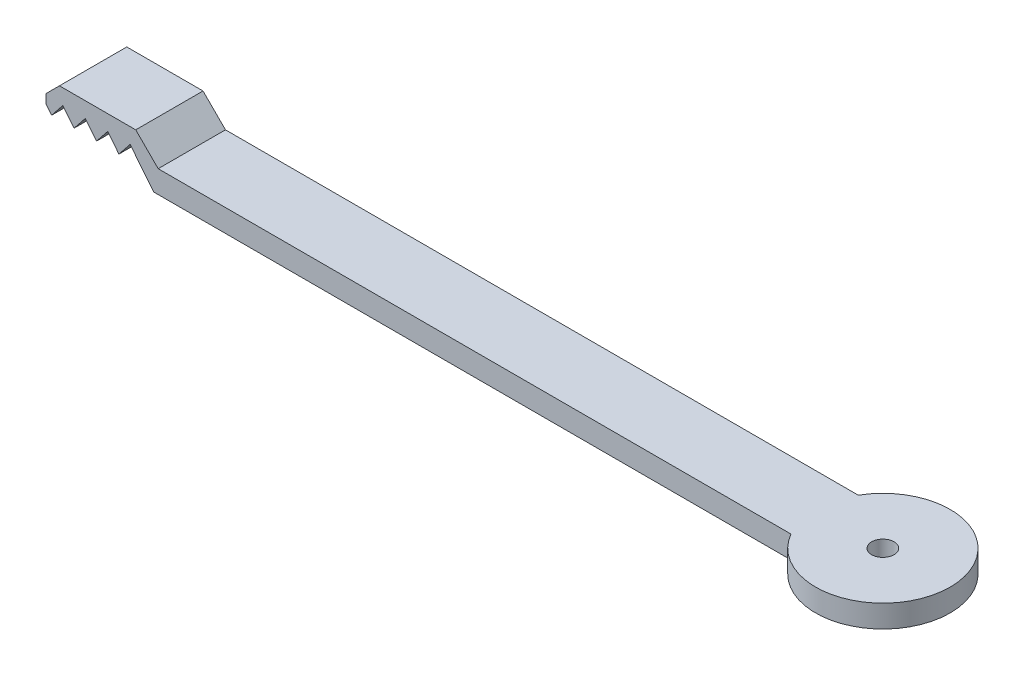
ISO-10303-21;
HEADER;
FILE_DESCRIPTION(('STEP AP214'),'2;1');
FILE_NAME('part.step','',(''),(''),'','','');
FILE_SCHEMA(('AUTOMOTIVE_DESIGN { 1 0 10303 214 1 1 1 1 }'));
ENDSEC;
DATA;
#1=APPLICATION_CONTEXT('core data for automotive mechanical design processes');
#2=APPLICATION_PROTOCOL_DEFINITION('international standard','automotive_design',2000,#1);
#3=PRODUCT_CONTEXT('',#1,'mechanical');
#4=PRODUCT('Part','Part','',(#3));
#5=PRODUCT_RELATED_PRODUCT_CATEGORY('part','',(#4));
#6=PRODUCT_DEFINITION_FORMATION('','',#4);
#7=PRODUCT_DEFINITION_CONTEXT('part definition',#1,'design');
#8=PRODUCT_DEFINITION('design','',#6,#7);
#9=PRODUCT_DEFINITION_SHAPE('','',#8);
#10=(LENGTH_UNIT() NAMED_UNIT(*) SI_UNIT(.MILLI.,.METRE.));
#11=(NAMED_UNIT(*) PLANE_ANGLE_UNIT() SI_UNIT($,.RADIAN.));
#12=(NAMED_UNIT(*) SI_UNIT($,.STERADIAN.) SOLID_ANGLE_UNIT());
#13=UNCERTAINTY_MEASURE_WITH_UNIT(LENGTH_MEASURE(1.E-05),#10,'distance_accuracy_value','');
#14=(GEOMETRIC_REPRESENTATION_CONTEXT(3) GLOBAL_UNCERTAINTY_ASSIGNED_CONTEXT((#13)) GLOBAL_UNIT_ASSIGNED_CONTEXT((#10,
#11,#12)) REPRESENTATION_CONTEXT('',''));
#15=CARTESIAN_POINT('',(0.,0.,0.));
#16=DIRECTION('',(0.,0.,1.));
#17=DIRECTION('',(1.,0.,0.));
#18=AXIS2_PLACEMENT_3D('',#15,#16,#17);
#19=CARTESIAN_POINT('',(157.736236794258,35.4387505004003,-55.01));
#20=DIRECTION('',(0.780624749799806,0.624999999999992,0.));
#21=DIRECTION('',(-0.624999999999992,0.780624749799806,0.));
#22=AXIS2_PLACEMENT_3D('',#19,#20,#21);
#23=PLANE('',#22);
#24=DIRECTION('',(0.624999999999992,-0.780624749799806,0.));
#25=VECTOR('',#24,1.);
#26=CARTESIAN_POINT('',(228.852940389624,-53.3859838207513,-32.5));
#27=LINE('',#26,#25);
#28=CARTESIAN_POINT('',(156.486236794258,37.,-32.4999999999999));
#29=VERTEX_POINT('',#28);
#30=CARTESIAN_POINT('',(157.736236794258,35.4387505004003,-32.4999999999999));
#31=VERTEX_POINT('',#30);
#32=EDGE_CURVE('E219',#29,#31,#27,.T.);
#33=ORIENTED_EDGE('',*,*,#32,.T.);
#34=DIRECTION('',(0.,0.,1.));
#35=VECTOR('',#34,1.);
#36=CARTESIAN_POINT('',(157.736236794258,35.4387505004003,-55.01));
#37=LINE('',#36,#35);
#38=CARTESIAN_POINT('',(157.736236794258,35.4387505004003,-17.5));
#39=VERTEX_POINT('',#38);
#40=EDGE_CURVE('E12',#31,#39,#37,.T.);
#41=ORIENTED_EDGE('',*,*,#40,.T.);
#42=DIRECTION('',(-0.624999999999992,0.780624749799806,0.));
#43=VECTOR('',#42,1.);
#44=CARTESIAN_POINT('',(228.852940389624,-53.3859838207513,-17.5));
#45=LINE('',#44,#43);
#46=CARTESIAN_POINT('',(156.486236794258,37.,-17.5));
#47=VERTEX_POINT('',#46);
#48=EDGE_CURVE('E65',#39,#47,#45,.T.);
#49=ORIENTED_EDGE('',*,*,#48,.T.);
#50=DIRECTION('',(0.,0.,1.));
#51=VECTOR('',#50,1.);
#52=CARTESIAN_POINT('',(156.486236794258,37.,-32.4999999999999));
#53=LINE('',#52,#51);
#54=EDGE_CURVE('E166',#29,#47,#53,.T.);
#55=ORIENTED_EDGE('',*,*,#54,.F.);
#56=EDGE_LOOP('',(#33,#41,#49,#55));
#57=FACE_BOUND('',#56,.T.);
#58=ADVANCED_FACE('F41',(#57),#23,.F.);
#59=CARTESIAN_POINT('',(158.986236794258,36.9999999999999,-55.01));
#60=DIRECTION('',(-0.780624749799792,0.625000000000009,0.));
#61=DIRECTION('',(-0.625000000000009,-0.780624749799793,0.));
#62=AXIS2_PLACEMENT_3D('',#59,#60,#61);
#63=PLANE('',#62);
#64=DIRECTION('',(0.625000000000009,0.780624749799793,0.));
#65=VECTOR('',#64,1.);
#66=CARTESIAN_POINT('',(225.497473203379,120.07250764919,-32.5));
#67=LINE('',#66,#65);
#68=CARTESIAN_POINT('',(160.236236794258,38.5612494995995,-32.4999999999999));
#69=VERTEX_POINT('',#68);
#70=EDGE_CURVE('E243',#31,#69,#67,.T.);
#71=ORIENTED_EDGE('',*,*,#70,.T.);
#72=DIRECTION('',(0.,0.,1.));
#73=VECTOR('',#72,1.);
#74=CARTESIAN_POINT('',(160.236236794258,38.5612494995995,-55.01));
#75=LINE('',#74,#73);
#76=CARTESIAN_POINT('',(160.236236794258,38.5612494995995,-17.5));
#77=VERTEX_POINT('',#76);
#78=EDGE_CURVE('E50',#69,#77,#75,.T.);
#79=ORIENTED_EDGE('',*,*,#78,.T.);
#80=DIRECTION('',(-0.625000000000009,-0.780624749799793,0.));
#81=VECTOR('',#80,1.);
#82=CARTESIAN_POINT('',(225.497473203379,120.07250764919,-17.5));
#83=LINE('',#82,#81);
#84=EDGE_CURVE('E197',#77,#39,#83,.T.);
#85=ORIENTED_EDGE('',*,*,#84,.T.);
#86=ORIENTED_EDGE('',*,*,#40,.F.);
#87=EDGE_LOOP('',(#71,#79,#85,#86));
#88=FACE_BOUND('',#87,.T.);
#89=ADVANCED_FACE('F325',(#88),#63,.F.);
#90=CARTESIAN_POINT('',(161.486236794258,36.9999999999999,-55.01));
#91=DIRECTION('',(0.780624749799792,0.625000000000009,0.));
#92=DIRECTION('',(-0.625000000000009,0.780624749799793,0.));
#93=AXIS2_PLACEMENT_3D('',#90,#91,#92);
#94=PLANE('',#93);
#95=DIRECTION('',(0.625000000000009,-0.780624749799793,0.));
#96=VECTOR('',#95,1.);
#97=CARTESIAN_POINT('',(231.899815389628,-50.9465314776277,-32.5));
#98=LINE('',#97,#96);
#99=CARTESIAN_POINT('',(162.736236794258,35.4387505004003,-32.4999999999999));
#100=VERTEX_POINT('',#99);
#101=EDGE_CURVE('E245',#69,#100,#98,.T.);
#102=ORIENTED_EDGE('',*,*,#101,.T.);
#103=DIRECTION('',(0.,0.,1.));
#104=VECTOR('',#103,1.);
#105=CARTESIAN_POINT('',(162.736236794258,35.4387505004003,-55.01));
#106=LINE('',#105,#104);
#107=CARTESIAN_POINT('',(162.736236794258,35.4387505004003,-17.5));
#108=VERTEX_POINT('',#107);
#109=EDGE_CURVE('E223',#100,#108,#106,.T.);
#110=ORIENTED_EDGE('',*,*,#109,.T.);
#111=DIRECTION('',(-0.625000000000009,0.780624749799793,0.));
#112=VECTOR('',#111,1.);
#113=CARTESIAN_POINT('',(231.899815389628,-50.9465314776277,-17.5));
#114=LINE('',#113,#112);
#115=EDGE_CURVE('E200',#108,#77,#114,.T.);
#116=ORIENTED_EDGE('',*,*,#115,.T.);
#117=ORIENTED_EDGE('',*,*,#78,.F.);
#118=EDGE_LOOP('',(#102,#110,#116,#117));
#119=FACE_BOUND('',#118,.T.);
#120=ADVANCED_FACE('F330',(#119),#94,.F.);
#121=CARTESIAN_POINT('',(163.986236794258,36.9999999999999,-55.01));
#122=DIRECTION('',(-0.780624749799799,0.625000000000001,0.));
#123=DIRECTION('',(-0.625000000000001,-0.780624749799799,0.));
#124=AXIS2_PLACEMENT_3D('',#121,#122,#123);
#125=PLANE('',#124);
#126=DIRECTION('',(0.625000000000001,0.780624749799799,0.));
#127=VECTOR('',#126,1.);
#128=CARTESIAN_POINT('',(228.544348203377,117.633055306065,-32.5));
#129=LINE('',#128,#127);
#130=CARTESIAN_POINT('',(165.236236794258,38.5612494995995,-32.4999999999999));
#131=VERTEX_POINT('',#130);
#132=EDGE_CURVE('E247',#100,#131,#129,.T.);
#133=ORIENTED_EDGE('',*,*,#132,.T.);
#134=DIRECTION('',(0.,0.,1.));
#135=VECTOR('',#134,1.);
#136=CARTESIAN_POINT('',(165.236236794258,38.5612494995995,-55.01));
#137=LINE('',#136,#135);
#138=CARTESIAN_POINT('',(165.236236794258,38.5612494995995,-17.5));
#139=VERTEX_POINT('',#138);
#140=EDGE_CURVE('E226',#131,#139,#137,.T.);
#141=ORIENTED_EDGE('',*,*,#140,.T.);
#142=DIRECTION('',(-0.625000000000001,-0.780624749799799,0.));
#143=VECTOR('',#142,1.);
#144=CARTESIAN_POINT('',(228.544348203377,117.633055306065,-17.5));
#145=LINE('',#144,#143);
#146=EDGE_CURVE('E203',#139,#108,#145,.T.);
#147=ORIENTED_EDGE('',*,*,#146,.T.);
#148=ORIENTED_EDGE('',*,*,#109,.F.);
#149=EDGE_LOOP('',(#133,#141,#147,#148));
#150=FACE_BOUND('',#149,.T.);
#151=ADVANCED_FACE('F336',(#150),#125,.F.);
#152=CARTESIAN_POINT('',(166.486236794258,37.,-55.01));
#153=DIRECTION('',(0.780624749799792,0.625000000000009,0.));
#154=DIRECTION('',(-0.625000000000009,0.780624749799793,0.));
#155=AXIS2_PLACEMENT_3D('',#152,#153,#154);
#156=PLANE('',#155);
#157=DIRECTION('',(0.625000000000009,-0.780624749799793,0.));
#158=VECTOR('',#157,1.);
#159=CARTESIAN_POINT('',(234.946690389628,-48.5070791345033,-32.5));
#160=LINE('',#159,#158);
#161=CARTESIAN_POINT('',(167.736236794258,35.4387505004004,-32.4999999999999));
#162=VERTEX_POINT('',#161);
#163=EDGE_CURVE('E249',#131,#162,#160,.T.);
#164=ORIENTED_EDGE('',*,*,#163,.T.);
#165=DIRECTION('',(0.,0.,1.));
#166=VECTOR('',#165,1.);
#167=CARTESIAN_POINT('',(167.736236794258,35.4387505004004,-55.01));
#168=LINE('',#167,#166);
#169=CARTESIAN_POINT('',(167.736236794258,35.4387505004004,-17.5));
#170=VERTEX_POINT('',#169);
#171=EDGE_CURVE('E229',#162,#170,#168,.T.);
#172=ORIENTED_EDGE('',*,*,#171,.T.);
#173=DIRECTION('',(-0.625000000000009,0.780624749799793,0.));
#174=VECTOR('',#173,1.);
#175=CARTESIAN_POINT('',(234.946690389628,-48.5070791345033,-17.5));
#176=LINE('',#175,#174);
#177=EDGE_CURVE('E206',#170,#139,#176,.T.);
#178=ORIENTED_EDGE('',*,*,#177,.T.);
#179=ORIENTED_EDGE('',*,*,#140,.F.);
#180=EDGE_LOOP('',(#164,#172,#178,#179));
#181=FACE_BOUND('',#180,.T.);
#182=ADVANCED_FACE('F340',(#181),#156,.F.);
#183=CARTESIAN_POINT('',(168.986236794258,37.,-55.01));
#184=DIRECTION('',(-0.780624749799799,0.625000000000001,0.));
#185=DIRECTION('',(-0.625000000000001,-0.780624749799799,0.));
#186=AXIS2_PLACEMENT_3D('',#183,#184,#185);
#187=PLANE('',#186);
#188=DIRECTION('',(0.625000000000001,0.780624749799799,0.));
#189=VECTOR('',#188,1.);
#190=CARTESIAN_POINT('',(231.591223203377,115.193602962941,-32.5));
#191=LINE('',#190,#189);
#192=CARTESIAN_POINT('',(170.236236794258,38.5612494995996,-32.4999999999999));
#193=VERTEX_POINT('',#192);
#194=EDGE_CURVE('E251',#162,#193,#191,.T.);
#195=ORIENTED_EDGE('',*,*,#194,.T.);
#196=DIRECTION('',(0.,0.,1.));
#197=VECTOR('',#196,1.);
#198=CARTESIAN_POINT('',(170.236236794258,38.5612494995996,-55.01));
#199=LINE('',#198,#197);
#200=CARTESIAN_POINT('',(170.236236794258,38.5612494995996,-17.5));
#201=VERTEX_POINT('',#200);
#202=EDGE_CURVE('E232',#193,#201,#199,.T.);
#203=ORIENTED_EDGE('',*,*,#202,.T.);
#204=DIRECTION('',(-0.625000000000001,-0.780624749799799,0.));
#205=VECTOR('',#204,1.);
#206=CARTESIAN_POINT('',(231.591223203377,115.193602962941,-17.5));
#207=LINE('',#206,#205);
#208=EDGE_CURVE('E209',#201,#170,#207,.T.);
#209=ORIENTED_EDGE('',*,*,#208,.T.);
#210=ORIENTED_EDGE('',*,*,#171,.F.);
#211=EDGE_LOOP('',(#195,#203,#209,#210));
#212=FACE_BOUND('',#211,.T.);
#213=ADVANCED_FACE('F344',(#212),#187,.F.);
#214=CARTESIAN_POINT('',(171.486236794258,37.,-55.01));
#215=DIRECTION('',(0.780624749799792,0.625000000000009,0.));
#216=DIRECTION('',(-0.625000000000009,0.780624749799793,0.));
#217=AXIS2_PLACEMENT_3D('',#214,#215,#216);
#218=PLANE('',#217);
#219=DIRECTION('',(0.625000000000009,-0.780624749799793,0.));
#220=VECTOR('',#219,1.);
#221=CARTESIAN_POINT('',(237.993565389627,-46.0676267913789,-32.5));
#222=LINE('',#221,#220);
#223=CARTESIAN_POINT('',(172.736236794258,35.4387505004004,-32.4999999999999));
#224=VERTEX_POINT('',#223);
#225=EDGE_CURVE('E253',#193,#224,#222,.T.);
#226=ORIENTED_EDGE('',*,*,#225,.T.);
#227=DIRECTION('',(0.,0.,1.));
#228=VECTOR('',#227,1.);
#229=CARTESIAN_POINT('',(172.736236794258,35.4387505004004,-55.01));
#230=LINE('',#229,#228);
#231=CARTESIAN_POINT('',(172.736236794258,35.4387505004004,-17.5));
#232=VERTEX_POINT('',#231);
#233=EDGE_CURVE('E235',#224,#232,#230,.T.);
#234=ORIENTED_EDGE('',*,*,#233,.T.);
#235=DIRECTION('',(-0.625000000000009,0.780624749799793,0.));
#236=VECTOR('',#235,1.);
#237=CARTESIAN_POINT('',(237.993565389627,-46.0676267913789,-17.5));
#238=LINE('',#237,#236);
#239=EDGE_CURVE('E212',#232,#201,#238,.T.);
#240=ORIENTED_EDGE('',*,*,#239,.T.);
#241=ORIENTED_EDGE('',*,*,#202,.F.);
#242=EDGE_LOOP('',(#226,#234,#240,#241));
#243=FACE_BOUND('',#242,.T.);
#244=ADVANCED_FACE('F348',(#243),#218,.F.);
#245=CARTESIAN_POINT('',(173.986236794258,37.,-55.01));
#246=DIRECTION('',(-0.780624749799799,0.625000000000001,0.));
#247=DIRECTION('',(-0.625000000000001,-0.780624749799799,0.));
#248=AXIS2_PLACEMENT_3D('',#245,#246,#247);
#249=PLANE('',#248);
#250=DIRECTION('',(0.625000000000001,0.780624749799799,0.));
#251=VECTOR('',#250,1.);
#252=CARTESIAN_POINT('',(234.638098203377,112.754150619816,-32.5));
#253=LINE('',#252,#251);
#254=CARTESIAN_POINT('',(175.236236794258,38.5612494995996,-32.4999999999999));
#255=VERTEX_POINT('',#254);
#256=EDGE_CURVE('E254',#224,#255,#253,.T.);
#257=ORIENTED_EDGE('',*,*,#256,.T.);
#258=DIRECTION('',(0.,0.,1.));
#259=VECTOR('',#258,1.);
#260=CARTESIAN_POINT('',(175.236236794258,38.5612494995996,-55.01));
#261=LINE('',#260,#259);
#262=CARTESIAN_POINT('',(175.236236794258,38.5612494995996,-17.5));
#263=VERTEX_POINT('',#262);
#264=EDGE_CURVE('E238',#255,#263,#261,.T.);
#265=ORIENTED_EDGE('',*,*,#264,.T.);
#266=DIRECTION('',(-0.625000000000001,-0.780624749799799,0.));
#267=VECTOR('',#266,1.);
#268=CARTESIAN_POINT('',(234.638098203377,112.754150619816,-17.5));
#269=LINE('',#268,#267);
#270=EDGE_CURVE('E215',#263,#232,#269,.T.);
#271=ORIENTED_EDGE('',*,*,#270,.T.);
#272=ORIENTED_EDGE('',*,*,#233,.F.);
#273=EDGE_LOOP('',(#257,#265,#271,#272));
#274=FACE_BOUND('',#273,.T.);
#275=ADVANCED_FACE('F351',(#274),#249,.F.);
#276=CARTESIAN_POINT('',(176.486236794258,37.,-55.01));
#277=DIRECTION('',(0.780624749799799,0.625000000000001,0.));
#278=DIRECTION('',(-0.625000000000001,0.780624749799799,0.));
#279=AXIS2_PLACEMENT_3D('',#276,#277,#278);
#280=PLANE('',#279);
#281=DIRECTION('',(0.625000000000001,-0.780624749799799,0.));
#282=VECTOR('',#281,1.);
#283=CARTESIAN_POINT('',(241.040440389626,-43.6281744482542,-32.5));
#284=LINE('',#283,#282);
#285=CARTESIAN_POINT('',(180.489440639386,32.,-32.4999999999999));
#286=VERTEX_POINT('',#285);
#287=EDGE_CURVE('E45',#255,#286,#284,.T.);
#288=ORIENTED_EDGE('',*,*,#287,.T.);
#289=DIRECTION('',(0.,0.,-1.));
#290=VECTOR('',#289,1.);
#291=CARTESIAN_POINT('',(180.489440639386,32.,0.));
#292=LINE('',#291,#290);
#293=CARTESIAN_POINT('',(180.489440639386,32.,-17.5));
#294=VERTEX_POINT('',#293);
#295=EDGE_CURVE('E196',#294,#286,#292,.T.);
#296=ORIENTED_EDGE('',*,*,#295,.F.);
#297=DIRECTION('',(-0.625000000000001,0.780624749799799,0.));
#298=VECTOR('',#297,1.);
#299=CARTESIAN_POINT('',(241.040440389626,-43.6281744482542,-17.5));
#300=LINE('',#299,#298);
#301=EDGE_CURVE('E58',#294,#263,#300,.T.);
#302=ORIENTED_EDGE('',*,*,#301,.T.);
#303=ORIENTED_EDGE('',*,*,#264,.F.);
#304=EDGE_LOOP('',(#288,#296,#302,#303));
#305=FACE_BOUND('',#304,.T.);
#306=ADVANCED_FACE('F43',(#305),#280,.F.);
#307=CARTESIAN_POINT('',(335.5,0.,-25.));
#308=DIRECTION('',(0.,1.,0.));
#309=DIRECTION('',(0.,0.,1.));
#310=AXIS2_PLACEMENT_3D('',#307,#308,#309);
#311=CYLINDRICAL_SURFACE('',#310,2.50000000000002);
#312=CARTESIAN_POINT('',(335.5,37.,-25.));
#313=DIRECTION('',(0.,1.,0.));
#314=DIRECTION('',(0.,0.,1.));
#315=AXIS2_PLACEMENT_3D('',#312,#313,#314);
#316=CIRCLE('',#315,2.50000000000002);
#317=CARTESIAN_POINT('',(335.5,37.,-22.5));
#318=VERTEX_POINT('',#317);
#319=EDGE_CURVE('E284',#318,#318,#316,.T.);
#320=ORIENTED_EDGE('',*,*,#319,.T.);
#321=EDGE_LOOP('',(#320));
#322=FACE_BOUND('',#321,.T.);
#323=CARTESIAN_POINT('',(335.5,32.,-25.));
#324=DIRECTION('',(0.,1.,0.));
#325=DIRECTION('',(0.,0.,1.));
#326=AXIS2_PLACEMENT_3D('',#323,#324,#325);
#327=CIRCLE('',#326,2.50000000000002);
#328=CARTESIAN_POINT('',(335.5,32.,-22.5));
#329=VERTEX_POINT('',#328);
#330=EDGE_CURVE('E281',#329,#329,#327,.T.);
#331=ORIENTED_EDGE('',*,*,#330,.F.);
#332=EDGE_LOOP('',(#331));
#333=FACE_BOUND('',#332,.T.);
#334=ADVANCED_FACE('F357',(#322,#333),#311,.F.);
#335=CARTESIAN_POINT('',(176.486236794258,42.,-32.4999999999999));
#336=DIRECTION('',(0.,1.,0.));
#337=DIRECTION('',(0.,0.,1.));
#338=AXIS2_PLACEMENT_3D('',#335,#336,#337);
#339=PLANE('',#338);
#340=DIRECTION('',(-1.,0.,0.));
#341=VECTOR('',#340,1.);
#342=CARTESIAN_POINT('',(176.486236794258,42.,-32.4999999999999));
#343=LINE('',#342,#341);
#344=CARTESIAN_POINT('',(176.486236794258,42.,-32.4999999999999));
#345=VERTEX_POINT('',#344);
#346=CARTESIAN_POINT('',(159.486236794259,42.,-32.4999999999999));
#347=VERTEX_POINT('',#346);
#348=EDGE_CURVE('E160',#345,#347,#343,.T.);
#349=ORIENTED_EDGE('',*,*,#348,.T.);
#350=DIRECTION('',(0.,0.,1.));
#351=VECTOR('',#350,1.);
#352=CARTESIAN_POINT('',(159.486236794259,42.,-32.4999999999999));
#353=LINE('',#352,#351);
#354=CARTESIAN_POINT('',(159.486236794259,42.,-17.5));
#355=VERTEX_POINT('',#354);
#356=EDGE_CURVE('E184',#347,#355,#353,.T.);
#357=ORIENTED_EDGE('',*,*,#356,.T.);
#358=DIRECTION('',(-1.,0.,0.));
#359=VECTOR('',#358,1.);
#360=CARTESIAN_POINT('',(176.486236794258,42.,-17.5));
#361=LINE('',#360,#359);
#362=CARTESIAN_POINT('',(176.486236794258,42.,-17.5));
#363=VERTEX_POINT('',#362);
#364=EDGE_CURVE('E163',#363,#355,#361,.T.);
#365=ORIENTED_EDGE('',*,*,#364,.F.);
#366=DIRECTION('',(0.,0.,1.));
#367=VECTOR('',#366,1.);
#368=CARTESIAN_POINT('',(176.486236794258,42.,-32.4999999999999));
#369=LINE('',#368,#367);
#370=EDGE_CURVE('E156',#345,#363,#369,.T.);
#371=ORIENTED_EDGE('',*,*,#370,.F.);
#372=EDGE_LOOP('',(#349,#357,#365,#371));
#373=FACE_BOUND('',#372,.T.);
#374=ADVANCED_FACE('F158',(#373),#339,.T.);
#375=CARTESIAN_POINT('',(181.486236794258,37.,0.));
#376=DIRECTION('',(-0.707106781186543,-0.707106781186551,0.));
#377=DIRECTION('',(0.,0.,1.));
#378=AXIS2_PLACEMENT_3D('',#375,#376,#377);
#379=PLANE('',#378);
#380=DIRECTION('',(0.707106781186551,-0.707106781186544,0.));
#381=VECTOR('',#380,1.);
#382=CARTESIAN_POINT('',(181.486236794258,37.,-32.4999999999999));
#383=LINE('',#382,#381);
#384=CARTESIAN_POINT('',(181.486236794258,37.,-32.4999999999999));
#385=VERTEX_POINT('',#384);
#386=EDGE_CURVE('E173',#345,#385,#383,.T.);
#387=ORIENTED_EDGE('',*,*,#386,.F.);
#388=ORIENTED_EDGE('',*,*,#370,.T.);
#389=DIRECTION('',(-0.707106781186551,0.707106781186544,0.));
#390=VECTOR('',#389,1.);
#391=CARTESIAN_POINT('',(181.486236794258,37.,-17.5));
#392=LINE('',#391,#390);
#393=CARTESIAN_POINT('',(181.486236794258,37.,-17.5));
#394=VERTEX_POINT('',#393);
#395=EDGE_CURVE('E185',#394,#363,#392,.T.);
#396=ORIENTED_EDGE('',*,*,#395,.F.);
#397=DIRECTION('',(0.,0.,1.));
#398=VECTOR('',#397,1.);
#399=CARTESIAN_POINT('',(181.486236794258,37.,0.));
#400=LINE('',#399,#398);
#401=EDGE_CURVE('E183',#385,#394,#400,.T.);
#402=ORIENTED_EDGE('',*,*,#401,.F.);
#403=EDGE_LOOP('',(#387,#388,#396,#402));
#404=FACE_BOUND('',#403,.T.);
#405=ADVANCED_FACE('F181',(#404),#379,.F.);
#406=CARTESIAN_POINT('',(0.,37.,0.));
#407=DIRECTION('',(0.,-1.,0.));
#408=DIRECTION('',(0.,0.,-1.));
#409=AXIS2_PLACEMENT_3D('',#406,#407,#408);
#410=PLANE('',#409);
#411=ORIENTED_EDGE('',*,*,#319,.F.);
#412=EDGE_LOOP('',(#411));
#413=FACE_BOUND('',#412,.T.);
#414=DIRECTION('',(-1.,0.,0.));
#415=VECTOR('',#414,1.);
#416=CARTESIAN_POINT('',(335.5,37.,-32.5));
#417=LINE('',#416,#415);
#418=CARTESIAN_POINT('',(322.509618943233,37.,-32.5));
#419=VERTEX_POINT('',#418);
#420=EDGE_CURVE('E274',#419,#385,#417,.T.);
#421=ORIENTED_EDGE('',*,*,#420,.T.);
#422=ORIENTED_EDGE('',*,*,#401,.T.);
#423=DIRECTION('',(1.,0.,0.));
#424=VECTOR('',#423,1.);
#425=CARTESIAN_POINT('',(335.5,37.,-17.5));
#426=LINE('',#425,#424);
#427=CARTESIAN_POINT('',(322.509618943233,37.,-17.5));
#428=VERTEX_POINT('',#427);
#429=EDGE_CURVE('E278',#394,#428,#426,.T.);
#430=ORIENTED_EDGE('',*,*,#429,.T.);
#431=CARTESIAN_POINT('',(335.5,37.,-25.));
#432=DIRECTION('',(0.,1.,0.));
#433=DIRECTION('',(0.,0.,1.));
#434=AXIS2_PLACEMENT_3D('',#431,#432,#433);
#435=CIRCLE('',#434,15.);
#436=EDGE_CURVE('E283',#428,#419,#435,.T.);
#437=ORIENTED_EDGE('',*,*,#436,.T.);
#438=EDGE_LOOP('',(#421,#422,#430,#437));
#439=FACE_BOUND('',#438,.T.);
#440=ADVANCED_FACE('F287',(#413,#439),#410,.F.);
#441=CARTESIAN_POINT('',(335.5,32.,-25.));
#442=DIRECTION('',(0.,1.,0.));
#443=DIRECTION('',(0.,0.,1.));
#444=AXIS2_PLACEMENT_3D('',#441,#442,#443);
#445=CYLINDRICAL_SURFACE('',#444,15.);
#446=CARTESIAN_POINT('',(335.5,32.,-25.));
#447=DIRECTION('',(0.,1.,0.));
#448=DIRECTION('',(0.,0.,1.));
#449=AXIS2_PLACEMENT_3D('',#446,#447,#448);
#450=CIRCLE('',#449,15.);
#451=CARTESIAN_POINT('',(322.509618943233,32.,-17.5));
#452=VERTEX_POINT('',#451);
#453=CARTESIAN_POINT('',(322.509618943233,32.,-32.5));
#454=VERTEX_POINT('',#453);
#455=EDGE_CURVE('E294',#452,#454,#450,.T.);
#456=ORIENTED_EDGE('',*,*,#455,.T.);
#457=DIRECTION('',(0.,1.,0.));
#458=VECTOR('',#457,1.);
#459=CARTESIAN_POINT('',(322.509618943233,32.,-32.5));
#460=LINE('',#459,#458);
#461=EDGE_CURVE('E266',#454,#419,#460,.T.);
#462=ORIENTED_EDGE('',*,*,#461,.T.);
#463=ORIENTED_EDGE('',*,*,#436,.F.);
#464=DIRECTION('',(0.,1.,0.));
#465=VECTOR('',#464,1.);
#466=CARTESIAN_POINT('',(322.509618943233,32.,-17.5));
#467=LINE('',#466,#465);
#468=EDGE_CURVE('E269',#428,#452,#467,.F.);
#469=ORIENTED_EDGE('',*,*,#468,.T.);
#470=EDGE_LOOP('',(#456,#462,#463,#469));
#471=FACE_BOUND('',#470,.T.);
#472=ADVANCED_FACE('F293',(#471),#445,.T.);
#473=CARTESIAN_POINT('',(0.,32.,0.));
#474=DIRECTION('',(0.,1.,0.));
#475=DIRECTION('',(0.,0.,1.));
#476=AXIS2_PLACEMENT_3D('',#473,#474,#475);
#477=PLANE('',#476);
#478=ORIENTED_EDGE('',*,*,#330,.T.);
#479=EDGE_LOOP('',(#478));
#480=FACE_BOUND('',#479,.T.);
#481=DIRECTION('',(1.,0.,0.));
#482=VECTOR('',#481,1.);
#483=CARTESIAN_POINT('',(335.5,32.,-17.5));
#484=LINE('',#483,#482);
#485=EDGE_CURVE('E270',#294,#452,#484,.T.);
#486=ORIENTED_EDGE('',*,*,#485,.F.);
#487=ORIENTED_EDGE('',*,*,#295,.T.);
#488=DIRECTION('',(-1.,0.,0.));
#489=VECTOR('',#488,1.);
#490=CARTESIAN_POINT('',(335.5,32.,-32.5));
#491=LINE('',#490,#489);
#492=EDGE_CURVE('E265',#454,#286,#491,.T.);
#493=ORIENTED_EDGE('',*,*,#492,.F.);
#494=ORIENTED_EDGE('',*,*,#455,.F.);
#495=EDGE_LOOP('',(#486,#487,#493,#494));
#496=FACE_BOUND('',#495,.T.);
#497=ADVANCED_FACE('F295',(#480,#496),#477,.F.);
#498=CARTESIAN_POINT('',(335.5,32.,-32.5));
#499=DIRECTION('',(0.,0.,-1.));
#500=DIRECTION('',(-1.,0.,0.));
#501=AXIS2_PLACEMENT_3D('',#498,#499,#500);
#502=PLANE('',#501);
#503=ORIENTED_EDGE('',*,*,#287,.F.);
#504=ORIENTED_EDGE('',*,*,#256,.F.);
#505=ORIENTED_EDGE('',*,*,#225,.F.);
#506=ORIENTED_EDGE('',*,*,#194,.F.);
#507=ORIENTED_EDGE('',*,*,#163,.F.);
#508=ORIENTED_EDGE('',*,*,#132,.F.);
#509=ORIENTED_EDGE('',*,*,#101,.F.);
#510=ORIENTED_EDGE('',*,*,#70,.F.);
#511=ORIENTED_EDGE('',*,*,#32,.F.);
#512=DIRECTION('',(0.,-1.,0.));
#513=VECTOR('',#512,1.);
#514=CARTESIAN_POINT('',(156.486236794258,37.,-32.4999999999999));
#515=LINE('',#514,#513);
#516=CARTESIAN_POINT('',(156.486236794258,38.9999999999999,-32.4999999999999));
#517=VERTEX_POINT('',#516);
#518=EDGE_CURVE('E167',#517,#29,#515,.T.);
#519=ORIENTED_EDGE('',*,*,#518,.F.);
#520=DIRECTION('',(-0.707106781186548,-0.707106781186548,0.));
#521=VECTOR('',#520,1.);
#522=CARTESIAN_POINT('',(242.493118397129,125.006881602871,-32.5));
#523=LINE('',#522,#521);
#524=EDGE_CURVE('E177',#517,#347,#523,.F.);
#525=ORIENTED_EDGE('',*,*,#524,.T.);
#526=ORIENTED_EDGE('',*,*,#348,.F.);
#527=ORIENTED_EDGE('',*,*,#386,.T.);
#528=ORIENTED_EDGE('',*,*,#420,.F.);
#529=ORIENTED_EDGE('',*,*,#461,.F.);
#530=ORIENTED_EDGE('',*,*,#492,.T.);
#531=EDGE_LOOP('',(#503,#504,#505,#506,#507,#508,#509,#510,#511,#519,#525,#526,#527,#528,#529,#530));
#532=FACE_BOUND('',#531,.T.);
#533=ADVANCED_FACE('F171',(#532),#502,.T.);
#534=CARTESIAN_POINT('',(159.486236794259,42.,-32.4999999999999));
#535=DIRECTION('',(0.707106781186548,-0.707106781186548,0.));
#536=DIRECTION('',(0.,0.,1.));
#537=AXIS2_PLACEMENT_3D('',#534,#535,#536);
#538=PLANE('',#537);
#539=ORIENTED_EDGE('',*,*,#524,.F.);
#540=DIRECTION('',(0.,0.,-1.));
#541=VECTOR('',#540,1.);
#542=CARTESIAN_POINT('',(156.486236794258,38.9999999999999,-32.4999999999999));
#543=LINE('',#542,#541);
#544=CARTESIAN_POINT('',(156.486236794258,38.9999999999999,-17.5));
#545=VERTEX_POINT('',#544);
#546=EDGE_CURVE('E193',#545,#517,#543,.T.);
#547=ORIENTED_EDGE('',*,*,#546,.F.);
#548=DIRECTION('',(0.707106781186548,0.707106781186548,0.));
#549=VECTOR('',#548,1.);
#550=CARTESIAN_POINT('',(242.493118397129,125.006881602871,-17.5));
#551=LINE('',#550,#549);
#552=EDGE_CURVE('E187',#355,#545,#551,.F.);
#553=ORIENTED_EDGE('',*,*,#552,.F.);
#554=ORIENTED_EDGE('',*,*,#356,.F.);
#555=EDGE_LOOP('',(#539,#547,#553,#554));
#556=FACE_BOUND('',#555,.T.);
#557=ADVANCED_FACE('F312',(#556),#538,.F.);
#558=CARTESIAN_POINT('',(335.5,32.,-17.5));
#559=DIRECTION('',(0.,0.,1.));
#560=DIRECTION('',(1.,0.,0.));
#561=AXIS2_PLACEMENT_3D('',#558,#559,#560);
#562=PLANE('',#561);
#563=ORIENTED_EDGE('',*,*,#301,.F.);
#564=ORIENTED_EDGE('',*,*,#485,.T.);
#565=ORIENTED_EDGE('',*,*,#468,.F.);
#566=ORIENTED_EDGE('',*,*,#429,.F.);
#567=ORIENTED_EDGE('',*,*,#395,.T.);
#568=ORIENTED_EDGE('',*,*,#364,.T.);
#569=ORIENTED_EDGE('',*,*,#552,.T.);
#570=DIRECTION('',(0.,-1.,0.));
#571=VECTOR('',#570,1.);
#572=CARTESIAN_POINT('',(156.486236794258,37.,-17.5));
#573=LINE('',#572,#571);
#574=EDGE_CURVE('E178',#545,#47,#573,.T.);
#575=ORIENTED_EDGE('',*,*,#574,.T.);
#576=ORIENTED_EDGE('',*,*,#48,.F.);
#577=ORIENTED_EDGE('',*,*,#84,.F.);
#578=ORIENTED_EDGE('',*,*,#115,.F.);
#579=ORIENTED_EDGE('',*,*,#146,.F.);
#580=ORIENTED_EDGE('',*,*,#177,.F.);
#581=ORIENTED_EDGE('',*,*,#208,.F.);
#582=ORIENTED_EDGE('',*,*,#239,.F.);
#583=ORIENTED_EDGE('',*,*,#270,.F.);
#584=EDGE_LOOP('',(#563,#564,#565,#566,#567,#568,#569,#575,#576,#577,#578,#579,#580,#581,#582,#583));
#585=FACE_BOUND('',#584,.T.);
#586=ADVANCED_FACE('F291',(#585),#562,.T.);
#587=CARTESIAN_POINT('',(156.486236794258,37.,-32.4999999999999));
#588=DIRECTION('',(-1.,0.,0.));
#589=DIRECTION('',(0.,0.,1.));
#590=AXIS2_PLACEMENT_3D('',#587,#588,#589);
#591=PLANE('',#590);
#592=ORIENTED_EDGE('',*,*,#574,.F.);
#593=ORIENTED_EDGE('',*,*,#546,.T.);
#594=ORIENTED_EDGE('',*,*,#518,.T.);
#595=ORIENTED_EDGE('',*,*,#54,.T.);
#596=EDGE_LOOP('',(#592,#593,#594,#595));
#597=FACE_BOUND('',#596,.T.);
#598=ADVANCED_FACE('F307',(#597),#591,.T.);
#599=CLOSED_SHELL('',(#58,#89,#120,#151,#182,#213,#244,#275,#306,#334,#374,#405,#440,#472,#497,
#533,#557,#586,#598));
#600=MANIFOLD_SOLID_BREP('B2',#599);
#601=ADVANCED_BREP_SHAPE_REPRESENTATION('',(#18,#600),#14);
#602=SHAPE_DEFINITION_REPRESENTATION(#9,#601);
ENDSEC;
END-ISO-10303-21;
